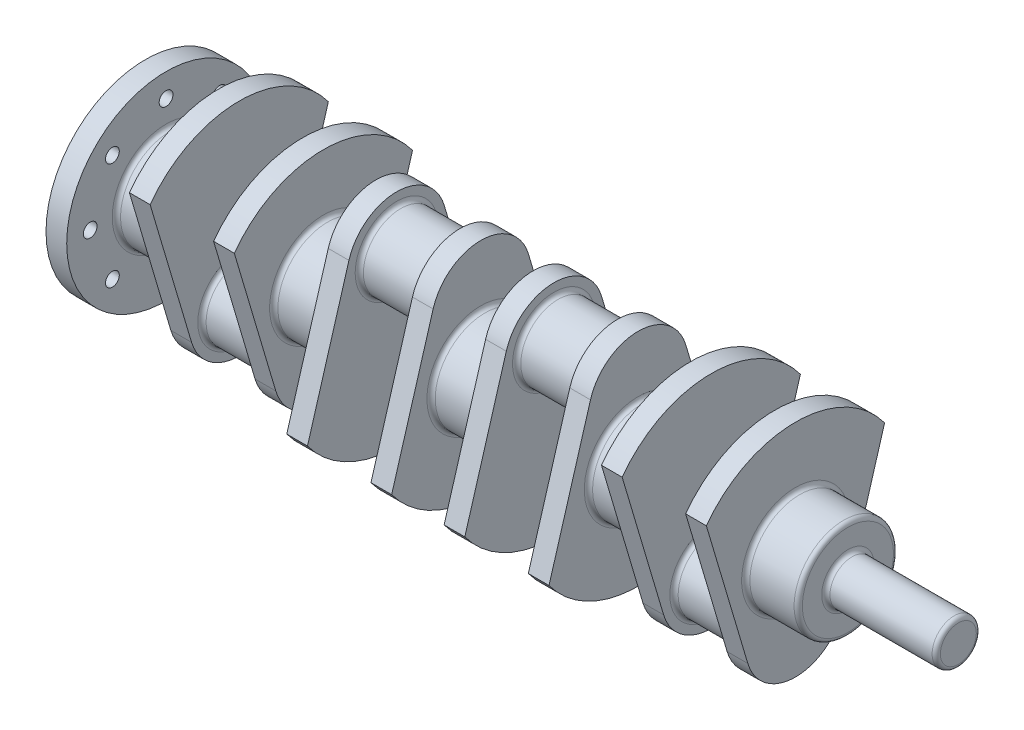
from build123d import *

# Parameters (mm, degrees)
SKETCH1_R             = 36
BOSS_EXTRUDE1_DEPTH   = 15
SKETCH2_R             = 27
BOSS_EXTRUDE2_DEPTH   = 46
SKETCH3_R             = 36
BOSS_EXTRUDE3_DEPTH   = 38
BODY_MOVE_COPY1_ANGLE = 180
SKETCH4_R             = 16
BOSS_EXTRUDE4_DEPTH   = 80
SKETCH5_R             = 72
SKETCH5_R_2           = 5
BOSS_EXTRUDE5_DEPTH   = 15
FILLET1_R             = 3


with BuildPart() as part:
    # Sketch1 → Boss-Extrude1 (new body)
    with BuildSketch(Plane(origin=(0, 0, 0), x_dir=(0, 0, -1), z_dir=(1, 0, 0))):
        with BuildLine():
            ThreePointArc((64.569893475, 47.23059238), (0, 80), (-64.569893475, 47.23059238))
            Line((-64.569893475, 47.23059238), (-34.517510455, -54.224552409))
            ThreePointArc((-34.517510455, -54.224552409), (-5.165734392, -8.372550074), (36, -44))
            ThreePointArc((36, -44), (35.627449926, -49.165734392), (34.517510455, -54.224552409))
            Line((34.517510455, -54.224552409), (64.569893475, 47.23059238))
        make_face()
        with Locations((0, -44)):
            Circle(SKETCH1_R)
    extrude(amount=BOSS_EXTRUDE1_DEPTH)

    # Sketch2 → Boss-Extrude2 (add)
    with BuildSketch(Plane.ZY):
        with Locations(Location((0, -44, 0), (0, 0, 180))):
            Circle(SKETCH2_R)
    extrude(amount=BOSS_EXTRUDE2_DEPTH)

    # Sketch3 → Boss-Extrude3 (add)
    with BuildSketch(Plane(origin=(15, 0, 0), x_dir=(0, 0, -1), z_dir=(1, 0, 0))):
        Circle(SKETCH3_R)
    extrude(amount=BOSS_EXTRUDE3_DEPTH)

    # Mirror1: part across plane


with BuildPart() as part_1:
    add(part.part)
    add(part.part.mirror(Plane.ZY.offset(23)))


with BuildPart() as body_2:
    # Mirror2: mirrored copy
    add(part_1.part.mirror(Plane.ZY.offset(80)))


with BuildPart() as body_2_1:
    # Body-Move_Copy1: moved
    add(body_2.part.rotate(Axis((0, 0, 0), (1, 0, 0)), BODY_MOVE_COPY1_ANGLE))


with BuildPart() as body_3:
    # Mirror3: mirrored copy
    add(part_1.part.mirror(Plane.ZY.offset(194)))

    # Sketch5 → Boss-Extrude5 (add)
    with BuildSketch(Plane.ZY.offset(441)):
        Circle(SKETCH5_R)
        with Locations((0, 55)):
            Circle(SKETCH5_R_2, mode=Mode.SUBTRACT)
        with Locations((38.890872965, 38.890872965)):
            Circle(SKETCH5_R_2, mode=Mode.SUBTRACT)
        with Locations((55, 0)):
            Circle(SKETCH5_R_2, mode=Mode.SUBTRACT)
        with Locations((38.890872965, -38.890872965)):
            Circle(SKETCH5_R_2, mode=Mode.SUBTRACT)
        with Locations((0, -55)):
            Circle(SKETCH5_R_2, mode=Mode.SUBTRACT)
        with Locations((-38.890872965, -38.890872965)):
            Circle(SKETCH5_R_2, mode=Mode.SUBTRACT)
        with Locations((-55, 0)):
            Circle(SKETCH5_R_2, mode=Mode.SUBTRACT)
        with Locations((-38.890872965, 38.890872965)):
            Circle(SKETCH5_R_2, mode=Mode.SUBTRACT)
    extrude(amount=BOSS_EXTRUDE5_DEPTH)


with BuildPart() as body_4:
    # Mirror3 2: mirrored copy
    add(body_2_1.part.mirror(Plane.ZY.offset(194)))


with BuildPart() as part_2:
    add(part_1.part)

    # Sketch4 → Boss-Extrude4 (add)
    with BuildSketch(Plane(origin=(53, 0, 0), x_dir=(0, 0, -1), z_dir=(1, 0, 0))):
        Circle(SKETCH4_R)
    extrude(amount=BOSS_EXTRUDE4_DEPTH)

    # Combine1: union body 2, body 4, body 3
    add(body_2_1.part)
    add(body_4.part)
    add(body_3.part)

    # Fillet1
    fillet1_edges = [part_2.edges().sort_by_distance(p)[0] for p in [
        (0, -44, 27),
        (-46, -44, 27),
        (15, 0, 36),
        (53, 0, 36),
        (-61, 0, 36),
        (53, 0, 16),
        (133, 0, 16),
        (-175, 0, -36),
        (-160, 44, -27),
        (-114, 44, -27),
        (-213, 0, -36),
        (-99, 0, 36),
        (-228, 44, -27),
        (-289, 0, -36),
        (-274, 44, -27),
        (-327, 0, -36),
        (-403, 0, 36),
        (-388, -44, 27),
        (-342, -44, 27),
        (-441, 0, 36),
    ]]
    fillet(fillet1_edges, radius=FILLET1_R)


solid = part_2.part
